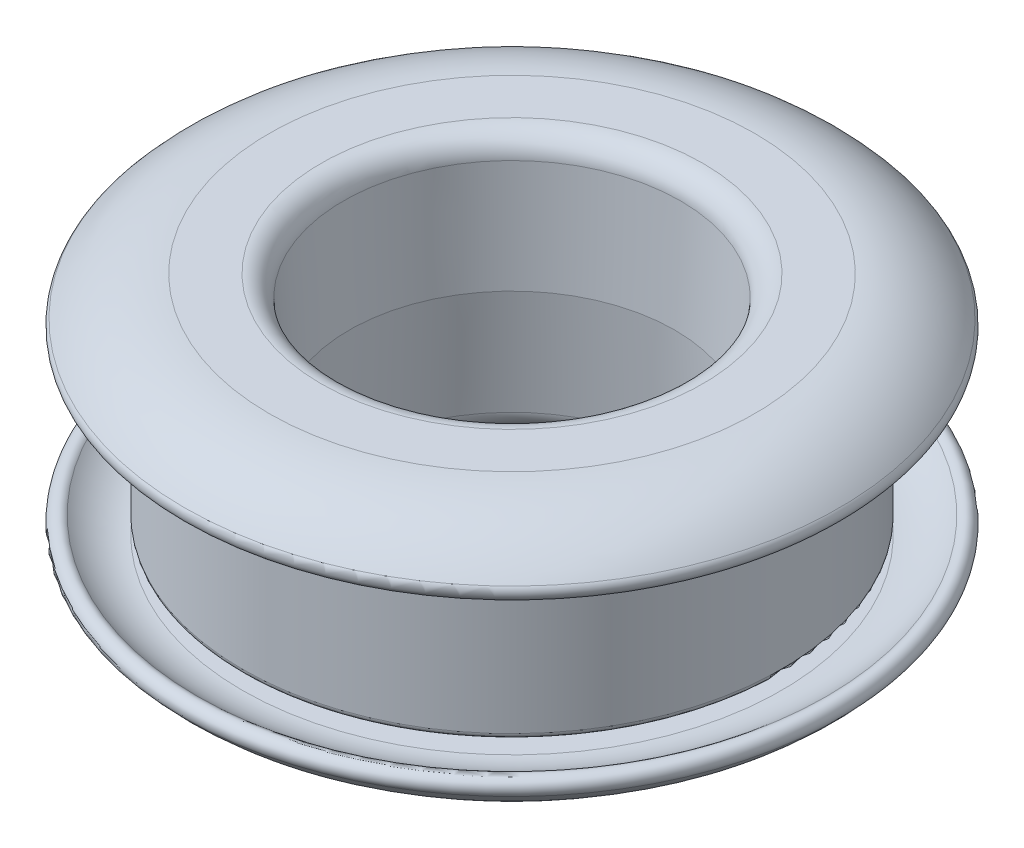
ISO-10303-21;
HEADER;
FILE_DESCRIPTION(('STEP AP214'),'2;1');
FILE_NAME('part.step','',(''),(''),'','','');
FILE_SCHEMA(('AUTOMOTIVE_DESIGN { 1 0 10303 214 1 1 1 1 }'));
ENDSEC;
DATA;
#1=APPLICATION_CONTEXT('core data for automotive mechanical design processes');
#2=APPLICATION_PROTOCOL_DEFINITION('international standard','automotive_design',2000,#1);
#3=PRODUCT_CONTEXT('',#1,'mechanical');
#4=PRODUCT('Part','Part','',(#3));
#5=PRODUCT_RELATED_PRODUCT_CATEGORY('part','',(#4));
#6=PRODUCT_DEFINITION_FORMATION('','',#4);
#7=PRODUCT_DEFINITION_CONTEXT('part definition',#1,'design');
#8=PRODUCT_DEFINITION('design','',#6,#7);
#9=PRODUCT_DEFINITION_SHAPE('','',#8);
#10=(LENGTH_UNIT() NAMED_UNIT(*) SI_UNIT(.MILLI.,.METRE.));
#11=(NAMED_UNIT(*) PLANE_ANGLE_UNIT() SI_UNIT($,.RADIAN.));
#12=(NAMED_UNIT(*) SI_UNIT($,.STERADIAN.) SOLID_ANGLE_UNIT());
#13=UNCERTAINTY_MEASURE_WITH_UNIT(LENGTH_MEASURE(1.E-05),#10,'distance_accuracy_value','');
#14=(GEOMETRIC_REPRESENTATION_CONTEXT(3) GLOBAL_UNCERTAINTY_ASSIGNED_CONTEXT((#13)) GLOBAL_UNIT_ASSIGNED_CONTEXT((#10,
#11,#12)) REPRESENTATION_CONTEXT('',''));
#15=CARTESIAN_POINT('',(0.,0.,0.));
#16=DIRECTION('',(0.,0.,1.));
#17=DIRECTION('',(1.,0.,0.));
#18=AXIS2_PLACEMENT_3D('',#15,#16,#17);
#19=CARTESIAN_POINT('',(0.,12.3249333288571,0.));
#20=DIRECTION('',(0.,1.,0.));
#21=DIRECTION('',(0.,0.,1.));
#22=AXIS2_PLACEMENT_3D('',#19,#20,#21);
#23=CONICAL_SURFACE('',#22,19.05,0.05235987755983);
#24=CARTESIAN_POINT('',(0.,0.,0.));
#25=DIRECTION('',(0.,-1.,0.));
#26=DIRECTION('',(0.,0.,-1.));
#27=AXIS2_PLACEMENT_3D('',#24,#25,#26);
#28=CIRCLE('',#27,18.4040776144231);
#29=CARTESIAN_POINT('',(0.,0.,-18.4040776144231));
#30=VERTEX_POINT('',#29);
#31=EDGE_CURVE('E94',#30,#30,#28,.T.);
#32=ORIENTED_EDGE('',*,*,#31,.T.);
#33=EDGE_LOOP('',(#32));
#34=FACE_BOUND('',#33,.T.);
#35=CARTESIAN_POINT('',(0.,12.3249333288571,0.));
#36=DIRECTION('',(0.,-1.,0.));
#37=DIRECTION('',(0.,0.,-1.));
#38=AXIS2_PLACEMENT_3D('',#35,#36,#37);
#39=CIRCLE('',#38,19.05);
#40=CARTESIAN_POINT('',(0.,12.3249333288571,-19.05));
#41=VERTEX_POINT('',#40);
#42=EDGE_CURVE('E62',#41,#41,#39,.T.);
#43=ORIENTED_EDGE('',*,*,#42,.F.);
#44=EDGE_LOOP('',(#43));
#45=FACE_BOUND('',#44,.T.);
#46=ADVANCED_FACE('F36',(#34,#45),#23,.F.);
#47=CARTESIAN_POINT('',(0.,12.192,0.));
#48=DIRECTION('',(0.,-1.,0.));
#49=DIRECTION('',(0.,0.,-1.));
#50=AXIS2_PLACEMENT_3D('',#47,#48,#49);
#51=TOROIDAL_SURFACE('',#50,21.5865190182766,2.54);
#52=ORIENTED_EDGE('',*,*,#42,.T.);
#53=EDGE_LOOP('',(#52));
#54=FACE_BOUND('',#53,.T.);
#55=CARTESIAN_POINT('',(0.,14.732,0.));
#56=DIRECTION('',(0.,-1.,0.));
#57=DIRECTION('',(0.,0.,-1.));
#58=AXIS2_PLACEMENT_3D('',#55,#56,#57);
#59=CIRCLE('',#58,21.5865190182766);
#60=CARTESIAN_POINT('',(0.,14.732,-21.5865190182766));
#61=VERTEX_POINT('',#60);
#62=EDGE_CURVE('E66',#61,#61,#59,.T.);
#63=ORIENTED_EDGE('',*,*,#62,.F.);
#64=EDGE_LOOP('',(#63));
#65=FACE_BOUND('',#64,.T.);
#66=ADVANCED_FACE('F143',(#54,#65),#51,.T.);
#67=CARTESIAN_POINT('',(21.5865190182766,14.732,0.));
#68=DIRECTION('',(0.,1.,0.));
#69=DIRECTION('',(0.,0.,1.));
#70=AXIS2_PLACEMENT_3D('',#67,#68,#69);
#71=PLANE('',#70);
#72=ORIENTED_EDGE('',*,*,#62,.T.);
#73=EDGE_LOOP('',(#72));
#74=FACE_BOUND('',#73,.T.);
#75=CARTESIAN_POINT('',(0.,14.732,0.));
#76=DIRECTION('',(0.,-1.,0.));
#77=DIRECTION('',(0.,0.,-1.));
#78=AXIS2_PLACEMENT_3D('',#75,#76,#77);
#79=CIRCLE('',#78,27.4444723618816);
#80=CARTESIAN_POINT('',(0.,14.732,-27.4444723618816));
#81=VERTEX_POINT('',#80);
#82=EDGE_CURVE('E70',#81,#81,#79,.T.);
#83=ORIENTED_EDGE('',*,*,#82,.F.);
#84=EDGE_LOOP('',(#83));
#85=FACE_BOUND('',#84,.T.);
#86=ADVANCED_FACE('F149',(#74,#85),#71,.T.);
#87=CARTESIAN_POINT('',(0.,2.17906123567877,0.));
#88=DIRECTION('',(0.,-1.,0.));
#89=DIRECTION('',(0.,0.,-1.));
#90=AXIS2_PLACEMENT_3D('',#87,#88,#89);
#91=TOROIDAL_SURFACE('',#90,27.4444723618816,12.5529387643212);
#92=ORIENTED_EDGE('',*,*,#82,.T.);
#93=EDGE_LOOP('',(#92));
#94=FACE_BOUND('',#93,.T.);
#95=CARTESIAN_POINT('',(0.,10.3021099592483,0.));
#96=DIRECTION('',(0.,-1.,0.));
#97=DIRECTION('',(0.,0.,-1.));
#98=AXIS2_PLACEMENT_3D('',#95,#96,#97);
#99=CIRCLE('',#98,37.0148616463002);
#100=CARTESIAN_POINT('',(0.,10.3021099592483,-37.0148616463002));
#101=VERTEX_POINT('',#100);
#102=EDGE_CURVE('E74',#101,#101,#99,.T.);
#103=ORIENTED_EDGE('',*,*,#102,.F.);
#104=EDGE_LOOP('',(#103));
#105=FACE_BOUND('',#104,.T.);
#106=ADVANCED_FACE('F196',(#94,#105),#91,.T.);
#107=CARTESIAN_POINT('',(0.,9.64465295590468,0.));
#108=DIRECTION('',(0.,-1.,0.));
#109=DIRECTION('',(0.,0.,-1.));
#110=AXIS2_PLACEMENT_3D('',#107,#108,#109);
#111=TOROIDAL_SURFACE('',#110,36.2402609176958,1.016);
#112=ORIENTED_EDGE('',*,*,#102,.T.);
#113=EDGE_LOOP('',(#112));
#114=FACE_BOUND('',#113,.T.);
#115=CARTESIAN_POINT('',(0.,8.89000000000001,0.));
#116=DIRECTION('',(0.,-1.,0.));
#117=DIRECTION('',(0.,0.,-1.));
#118=AXIS2_PLACEMENT_3D('',#115,#116,#117);
#119=CIRCLE('',#118,35.56);
#120=CARTESIAN_POINT('',(0.,8.89000000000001,-35.56));
#121=VERTEX_POINT('',#120);
#122=EDGE_CURVE('E78',#121,#121,#119,.T.);
#123=ORIENTED_EDGE('',*,*,#122,.F.);
#124=EDGE_LOOP('',(#123));
#125=FACE_BOUND('',#124,.T.);
#126=ADVANCED_FACE('F192',(#114,#125),#111,.T.);
#127=CARTESIAN_POINT('',(0.,3.2544608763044,0.));
#128=DIRECTION('',(0.,-1.,0.));
#129=DIRECTION('',(0.,0.,-1.));
#130=AXIS2_PLACEMENT_3D('',#127,#128,#129);
#131=TOROIDAL_SURFACE('',#130,30.48,7.58720641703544);
#132=ORIENTED_EDGE('',*,*,#122,.T.);
#133=EDGE_LOOP('',(#132));
#134=FACE_BOUND('',#133,.T.);
#135=CARTESIAN_POINT('',(0.,10.8416672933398,0.));
#136=DIRECTION('',(0.,-1.,0.));
#137=DIRECTION('',(0.,0.,-1.));
#138=AXIS2_PLACEMENT_3D('',#135,#136,#137);
#139=CIRCLE('',#138,30.48);
#140=CARTESIAN_POINT('',(0.,10.8416672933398,-30.48));
#141=VERTEX_POINT('',#140);
#142=EDGE_CURVE('E82',#141,#141,#139,.T.);
#143=ORIENTED_EDGE('',*,*,#142,.F.);
#144=EDGE_LOOP('',(#143));
#145=FACE_BOUND('',#144,.T.);
#146=ADVANCED_FACE('F186',(#134,#145),#131,.F.);
#147=CARTESIAN_POINT('',(24.820547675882,10.8416672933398,0.));
#148=DIRECTION('',(0.,-1.,0.));
#149=DIRECTION('',(0.,0.,-1.));
#150=AXIS2_PLACEMENT_3D('',#147,#148,#149);
#151=PLANE('',#150);
#152=ORIENTED_EDGE('',*,*,#142,.T.);
#153=EDGE_LOOP('',(#152));
#154=FACE_BOUND('',#153,.T.);
#155=CARTESIAN_POINT('',(0.,10.8416672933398,0.));
#156=DIRECTION('',(0.,-1.,0.));
#157=DIRECTION('',(0.,0.,-1.));
#158=AXIS2_PLACEMENT_3D('',#155,#156,#157);
#159=CIRCLE('',#158,24.820547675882);
#160=CARTESIAN_POINT('',(0.,10.8416672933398,-24.820547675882));
#161=VERTEX_POINT('',#160);
#162=EDGE_CURVE('E86',#161,#161,#159,.T.);
#163=ORIENTED_EDGE('',*,*,#162,.F.);
#164=EDGE_LOOP('',(#163));
#165=FACE_BOUND('',#164,.T.);
#166=ADVANCED_FACE('F180',(#154,#165),#151,.T.);
#167=CARTESIAN_POINT('',(0.,10.1198336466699,0.));
#168=DIRECTION('',(0.,-1.,0.));
#169=DIRECTION('',(0.,0.,-1.));
#170=AXIS2_PLACEMENT_3D('',#167,#168,#169);
#171=TOROIDAL_SURFACE('',#170,24.13,0.998949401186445);
#172=ORIENTED_EDGE('',*,*,#162,.T.);
#173=EDGE_LOOP('',(#172));
#174=FACE_BOUND('',#173,.T.);
#175=CARTESIAN_POINT('',(0.,9.398,0.));
#176=DIRECTION('',(0.,-1.,0.));
#177=DIRECTION('',(0.,0.,-1.));
#178=AXIS2_PLACEMENT_3D('',#175,#176,#177);
#179=CIRCLE('',#178,24.820547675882);
#180=CARTESIAN_POINT('',(0.,9.398,-24.820547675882));
#181=VERTEX_POINT('',#180);
#182=EDGE_CURVE('E90',#181,#181,#179,.T.);
#183=ORIENTED_EDGE('',*,*,#182,.F.);
#184=EDGE_LOOP('',(#183));
#185=FACE_BOUND('',#184,.T.);
#186=ADVANCED_FACE('F175',(#174,#185),#171,.F.);
#187=CARTESIAN_POINT('',(30.48,9.398,0.));
#188=DIRECTION('',(0.,1.,0.));
#189=DIRECTION('',(0.,0.,1.));
#190=AXIS2_PLACEMENT_3D('',#187,#188,#189);
#191=PLANE('',#190);
#192=CARTESIAN_POINT('',(0.,9.398,0.));
#193=DIRECTION('',(0.,1.,0.));
#194=DIRECTION('',(0.,0.,1.));
#195=AXIS2_PLACEMENT_3D('',#192,#193,#194);
#196=CIRCLE('',#195,29.845);
#197=CARTESIAN_POINT('',(0.,9.398,29.845));
#198=VERTEX_POINT('',#197);
#199=EDGE_CURVE('E50',#198,#198,#196,.T.);
#200=ORIENTED_EDGE('',*,*,#199,.T.);
#201=EDGE_LOOP('',(#200));
#202=FACE_BOUND('',#201,.T.);
#203=ORIENTED_EDGE('',*,*,#182,.T.);
#204=EDGE_LOOP('',(#203));
#205=FACE_BOUND('',#204,.T.);
#206=ADVANCED_FACE('F166',(#202,#205),#191,.T.);
#207=CARTESIAN_POINT('',(0.,0.,0.));
#208=DIRECTION('',(0.,-1.,0.));
#209=DIRECTION('',(0.,0.,-1.));
#210=AXIS2_PLACEMENT_3D('',#207,#208,#209);
#211=CYLINDRICAL_SURFACE('',#210,30.48);
#212=CARTESIAN_POINT('',(0.,-8.763,0.));
#213=DIRECTION('',(0.,-1.,0.));
#214=DIRECTION('',(0.,0.,-1.));
#215=AXIS2_PLACEMENT_3D('',#212,#213,#214);
#216=CIRCLE('',#215,30.48);
#217=CARTESIAN_POINT('',(0.,-8.763,-30.48));
#218=VERTEX_POINT('',#217);
#219=EDGE_CURVE('E10',#218,#218,#216,.F.);
#220=ORIENTED_EDGE('',*,*,#219,.T.);
#221=EDGE_LOOP('',(#220));
#222=FACE_BOUND('',#221,.T.);
#223=CARTESIAN_POINT('',(0.,8.763,0.));
#224=DIRECTION('',(0.,1.,0.));
#225=DIRECTION('',(0.,0.,1.));
#226=AXIS2_PLACEMENT_3D('',#223,#224,#225);
#227=CIRCLE('',#226,30.48);
#228=CARTESIAN_POINT('',(0.,8.763,30.48));
#229=VERTEX_POINT('',#228);
#230=EDGE_CURVE('E56',#229,#229,#227,.F.);
#231=ORIENTED_EDGE('',*,*,#230,.T.);
#232=EDGE_LOOP('',(#231));
#233=FACE_BOUND('',#232,.T.);
#234=ADVANCED_FACE('F157',(#222,#233),#211,.T.);
#235=CARTESIAN_POINT('',(0.,8.763,0.));
#236=DIRECTION('',(0.,1.,0.));
#237=DIRECTION('',(0.,0.,1.));
#238=AXIS2_PLACEMENT_3D('',#235,#236,#237);
#239=TOROIDAL_SURFACE('',#238,29.845,0.635);
#240=ORIENTED_EDGE('',*,*,#199,.F.);
#241=EDGE_LOOP('',(#240));
#242=FACE_BOUND('',#241,.T.);
#243=ORIENTED_EDGE('',*,*,#230,.F.);
#244=EDGE_LOOP('',(#243));
#245=FACE_BOUND('',#244,.T.);
#246=ADVANCED_FACE('F154',(#242,#245),#239,.T.);
#247=CARTESIAN_POINT('',(0.,-12.3249333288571,0.));
#248=DIRECTION('',(0.,-1.,0.));
#249=DIRECTION('',(0.,0.,1.));
#250=AXIS2_PLACEMENT_3D('',#247,#248,#249);
#251=CONICAL_SURFACE('',#250,19.05,0.05235987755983);
#252=ORIENTED_EDGE('',*,*,#31,.F.);
#253=EDGE_LOOP('',(#252));
#254=FACE_BOUND('',#253,.T.);
#255=CARTESIAN_POINT('',(0.,-12.3249333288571,0.));
#256=DIRECTION('',(0.,-1.,0.));
#257=DIRECTION('',(0.,0.,-1.));
#258=AXIS2_PLACEMENT_3D('',#255,#256,#257);
#259=CIRCLE('',#258,19.05);
#260=CARTESIAN_POINT('',(0.,-12.3249333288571,-19.05));
#261=VERTEX_POINT('',#260);
#262=EDGE_CURVE('E98',#261,#261,#259,.T.);
#263=ORIENTED_EDGE('',*,*,#262,.T.);
#264=EDGE_LOOP('',(#263));
#265=FACE_BOUND('',#264,.T.);
#266=ADVANCED_FACE('F156',(#254,#265),#251,.F.);
#267=CARTESIAN_POINT('',(0.,-12.192,0.));
#268=DIRECTION('',(0.,1.,0.));
#269=DIRECTION('',(0.,0.,-1.));
#270=AXIS2_PLACEMENT_3D('',#267,#268,#269);
#271=TOROIDAL_SURFACE('',#270,21.5865190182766,2.54);
#272=ORIENTED_EDGE('',*,*,#262,.F.);
#273=EDGE_LOOP('',(#272));
#274=FACE_BOUND('',#273,.T.);
#275=CARTESIAN_POINT('',(0.,-14.732,0.));
#276=DIRECTION('',(0.,-1.,0.));
#277=DIRECTION('',(0.,0.,-1.));
#278=AXIS2_PLACEMENT_3D('',#275,#276,#277);
#279=CIRCLE('',#278,21.5865190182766);
#280=CARTESIAN_POINT('',(0.,-14.732,-21.5865190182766));
#281=VERTEX_POINT('',#280);
#282=EDGE_CURVE('E102',#281,#281,#279,.T.);
#283=ORIENTED_EDGE('',*,*,#282,.T.);
#284=EDGE_LOOP('',(#283));
#285=FACE_BOUND('',#284,.T.);
#286=ADVANCED_FACE('F163',(#274,#285),#271,.T.);
#287=CARTESIAN_POINT('',(21.5865190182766,-14.732,0.));
#288=DIRECTION('',(0.,-1.,0.));
#289=DIRECTION('',(0.,0.,1.));
#290=AXIS2_PLACEMENT_3D('',#287,#288,#289);
#291=PLANE('',#290);
#292=ORIENTED_EDGE('',*,*,#282,.F.);
#293=EDGE_LOOP('',(#292));
#294=FACE_BOUND('',#293,.T.);
#295=CARTESIAN_POINT('',(0.,-14.732,0.));
#296=DIRECTION('',(0.,-1.,0.));
#297=DIRECTION('',(0.,0.,-1.));
#298=AXIS2_PLACEMENT_3D('',#295,#296,#297);
#299=CIRCLE('',#298,27.4444723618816);
#300=CARTESIAN_POINT('',(0.,-14.732,-27.4444723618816));
#301=VERTEX_POINT('',#300);
#302=EDGE_CURVE('E106',#301,#301,#299,.T.);
#303=ORIENTED_EDGE('',*,*,#302,.T.);
#304=EDGE_LOOP('',(#303));
#305=FACE_BOUND('',#304,.T.);
#306=ADVANCED_FACE('F274',(#294,#305),#291,.T.);
#307=CARTESIAN_POINT('',(0.,-2.17906123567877,0.));
#308=DIRECTION('',(0.,1.,0.));
#309=DIRECTION('',(0.,0.,-1.));
#310=AXIS2_PLACEMENT_3D('',#307,#308,#309);
#311=TOROIDAL_SURFACE('',#310,27.4444723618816,12.5529387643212);
#312=ORIENTED_EDGE('',*,*,#302,.F.);
#313=EDGE_LOOP('',(#312));
#314=FACE_BOUND('',#313,.T.);
#315=CARTESIAN_POINT('',(0.,-10.3021099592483,0.));
#316=DIRECTION('',(0.,-1.,0.));
#317=DIRECTION('',(0.,0.,-1.));
#318=AXIS2_PLACEMENT_3D('',#315,#316,#317);
#319=CIRCLE('',#318,37.0148616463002);
#320=CARTESIAN_POINT('',(0.,-10.3021099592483,-37.0148616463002));
#321=VERTEX_POINT('',#320);
#322=EDGE_CURVE('E109',#321,#321,#319,.T.);
#323=ORIENTED_EDGE('',*,*,#322,.T.);
#324=EDGE_LOOP('',(#323));
#325=FACE_BOUND('',#324,.T.);
#326=ADVANCED_FACE('F270',(#314,#325),#311,.T.);
#327=CARTESIAN_POINT('',(0.,-9.64465295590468,0.));
#328=DIRECTION('',(0.,1.,0.));
#329=DIRECTION('',(0.,0.,-1.));
#330=AXIS2_PLACEMENT_3D('',#327,#328,#329);
#331=TOROIDAL_SURFACE('',#330,36.2402609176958,1.016);
#332=ORIENTED_EDGE('',*,*,#322,.F.);
#333=EDGE_LOOP('',(#332));
#334=FACE_BOUND('',#333,.T.);
#335=CARTESIAN_POINT('',(0.,-8.89000000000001,0.));
#336=DIRECTION('',(0.,-1.,0.));
#337=DIRECTION('',(0.,0.,-1.));
#338=AXIS2_PLACEMENT_3D('',#335,#336,#337);
#339=CIRCLE('',#338,35.56);
#340=CARTESIAN_POINT('',(0.,-8.89000000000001,-35.56));
#341=VERTEX_POINT('',#340);
#342=EDGE_CURVE('E113',#341,#341,#339,.T.);
#343=ORIENTED_EDGE('',*,*,#342,.T.);
#344=EDGE_LOOP('',(#343));
#345=FACE_BOUND('',#344,.T.);
#346=ADVANCED_FACE('F273',(#334,#345),#331,.T.);
#347=CARTESIAN_POINT('',(0.,-3.2544608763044,0.));
#348=DIRECTION('',(0.,1.,0.));
#349=DIRECTION('',(0.,0.,-1.));
#350=AXIS2_PLACEMENT_3D('',#347,#348,#349);
#351=TOROIDAL_SURFACE('',#350,30.48,7.58720641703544);
#352=ORIENTED_EDGE('',*,*,#342,.F.);
#353=EDGE_LOOP('',(#352));
#354=FACE_BOUND('',#353,.T.);
#355=CARTESIAN_POINT('',(0.,-10.8416672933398,0.));
#356=DIRECTION('',(0.,-1.,0.));
#357=DIRECTION('',(0.,0.,-1.));
#358=AXIS2_PLACEMENT_3D('',#355,#356,#357);
#359=CIRCLE('',#358,30.48);
#360=CARTESIAN_POINT('',(0.,-10.8416672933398,-30.48));
#361=VERTEX_POINT('',#360);
#362=EDGE_CURVE('E117',#361,#361,#359,.T.);
#363=ORIENTED_EDGE('',*,*,#362,.T.);
#364=EDGE_LOOP('',(#363));
#365=FACE_BOUND('',#364,.T.);
#366=ADVANCED_FACE('F250',(#354,#365),#351,.F.);
#367=CARTESIAN_POINT('',(24.820547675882,-10.8416672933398,0.));
#368=DIRECTION('',(0.,1.,0.));
#369=DIRECTION('',(0.,0.,-1.));
#370=AXIS2_PLACEMENT_3D('',#367,#368,#369);
#371=PLANE('',#370);
#372=ORIENTED_EDGE('',*,*,#362,.F.);
#373=EDGE_LOOP('',(#372));
#374=FACE_BOUND('',#373,.T.);
#375=CARTESIAN_POINT('',(0.,-10.8416672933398,0.));
#376=DIRECTION('',(0.,-1.,0.));
#377=DIRECTION('',(0.,0.,-1.));
#378=AXIS2_PLACEMENT_3D('',#375,#376,#377);
#379=CIRCLE('',#378,24.820547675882);
#380=CARTESIAN_POINT('',(0.,-10.8416672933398,-24.820547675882));
#381=VERTEX_POINT('',#380);
#382=EDGE_CURVE('E120',#381,#381,#379,.T.);
#383=ORIENTED_EDGE('',*,*,#382,.T.);
#384=EDGE_LOOP('',(#383));
#385=FACE_BOUND('',#384,.T.);
#386=ADVANCED_FACE('F139',(#374,#385),#371,.T.);
#387=CARTESIAN_POINT('',(0.,-10.1198336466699,0.));
#388=DIRECTION('',(0.,1.,0.));
#389=DIRECTION('',(0.,0.,-1.));
#390=AXIS2_PLACEMENT_3D('',#387,#388,#389);
#391=TOROIDAL_SURFACE('',#390,24.13,0.998949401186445);
#392=ORIENTED_EDGE('',*,*,#382,.F.);
#393=EDGE_LOOP('',(#392));
#394=FACE_BOUND('',#393,.T.);
#395=CARTESIAN_POINT('',(0.,-9.398,0.));
#396=DIRECTION('',(0.,-1.,0.));
#397=DIRECTION('',(0.,0.,-1.));
#398=AXIS2_PLACEMENT_3D('',#395,#396,#397);
#399=CIRCLE('',#398,24.820547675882);
#400=CARTESIAN_POINT('',(0.,-9.398,-24.820547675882));
#401=VERTEX_POINT('',#400);
#402=EDGE_CURVE('E124',#401,#401,#399,.T.);
#403=ORIENTED_EDGE('',*,*,#402,.T.);
#404=EDGE_LOOP('',(#403));
#405=FACE_BOUND('',#404,.T.);
#406=ADVANCED_FACE('F129',(#394,#405),#391,.F.);
#407=CARTESIAN_POINT('',(30.48,-9.398,0.));
#408=DIRECTION('',(0.,-1.,0.));
#409=DIRECTION('',(0.,0.,1.));
#410=AXIS2_PLACEMENT_3D('',#407,#408,#409);
#411=PLANE('',#410);
#412=CARTESIAN_POINT('',(0.,-9.398,0.));
#413=DIRECTION('',(0.,-1.,0.));
#414=DIRECTION('',(0.,0.,-1.));
#415=AXIS2_PLACEMENT_3D('',#412,#413,#414);
#416=CIRCLE('',#415,29.845);
#417=CARTESIAN_POINT('',(0.,-9.398,-29.845));
#418=VERTEX_POINT('',#417);
#419=EDGE_CURVE('E44',#418,#418,#416,.T.);
#420=ORIENTED_EDGE('',*,*,#419,.T.);
#421=EDGE_LOOP('',(#420));
#422=FACE_BOUND('',#421,.T.);
#423=ORIENTED_EDGE('',*,*,#402,.F.);
#424=EDGE_LOOP('',(#423));
#425=FACE_BOUND('',#424,.T.);
#426=ADVANCED_FACE('F131',(#422,#425),#411,.T.);
#427=CARTESIAN_POINT('',(0.,-8.763,0.));
#428=DIRECTION('',(0.,-1.,0.));
#429=DIRECTION('',(0.,0.,-1.));
#430=AXIS2_PLACEMENT_3D('',#427,#428,#429);
#431=TOROIDAL_SURFACE('',#430,29.845,0.635);
#432=ORIENTED_EDGE('',*,*,#219,.F.);
#433=EDGE_LOOP('',(#432));
#434=FACE_BOUND('',#433,.T.);
#435=ORIENTED_EDGE('',*,*,#419,.F.);
#436=EDGE_LOOP('',(#435));
#437=FACE_BOUND('',#436,.T.);
#438=ADVANCED_FACE('F38',(#434,#437),#431,.T.);
#439=CLOSED_SHELL('',(#46,#66,#86,#106,#126,#146,#166,#186,#206,#234,#246,#266,#286,#306,#326,
#346,#366,#386,#406,#426,#438));
#440=MANIFOLD_SOLID_BREP('B2',#439);
#441=ADVANCED_BREP_SHAPE_REPRESENTATION('',(#18,#440),#14);
#442=SHAPE_DEFINITION_REPRESENTATION(#9,#441);
ENDSEC;
END-ISO-10303-21;
